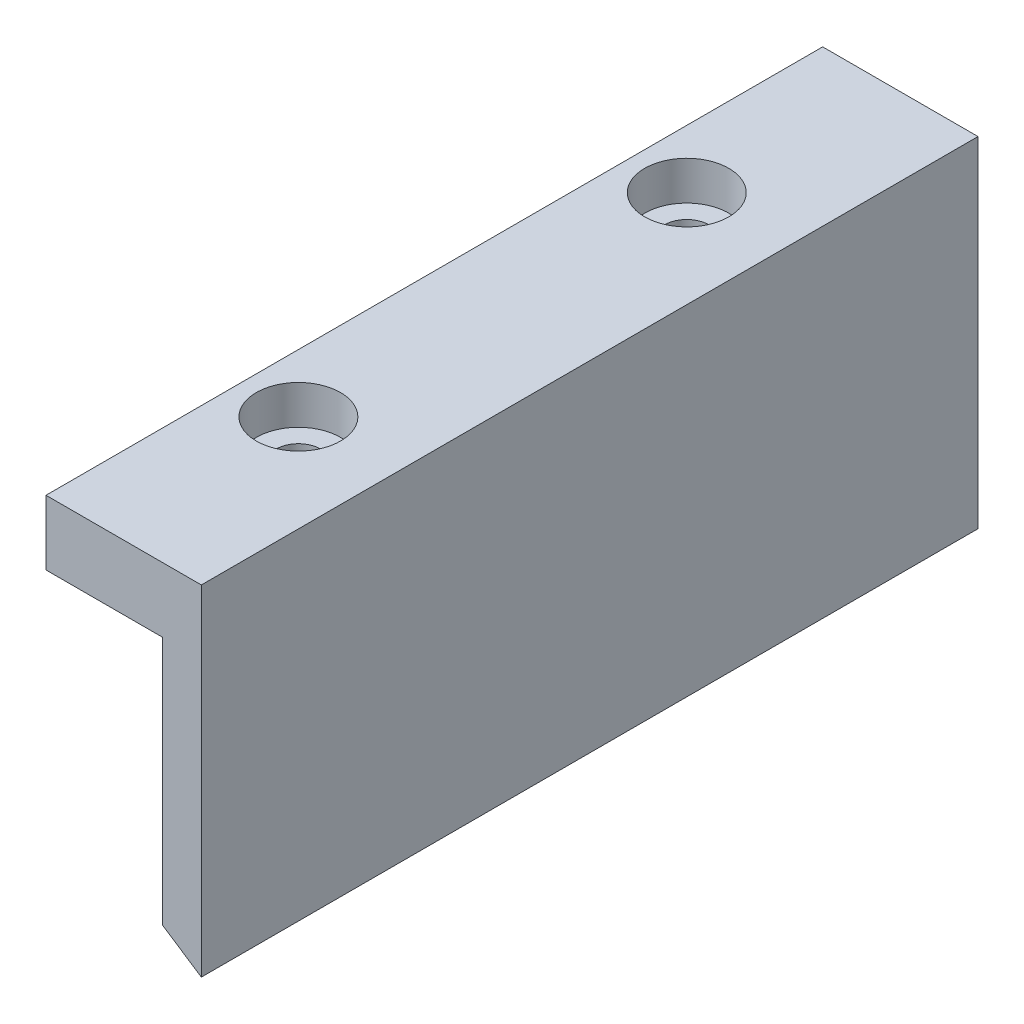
from build123d import *

# Parameters (mm, degrees)
BOSS_EXTRUDE1_DEPTH            = 60
CBORE_FOR_M3_SHCS1_D           = 3.4
CBORE_FOR_M3_SHCS1_DEPTH       = 5
CBORE_FOR_M3_SHCS1_CBORE_D     = 6.5
CBORE_FOR_M3_SHCS1_CBORE_DEPTH = 3
CBORE_FOR_M3_SHCS1_TIP         = 1.021463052


with BuildPart() as part:
    # Sketch3 → Boss-Extrude1 (new body)
    with BuildSketch(Plane.XY):
        Polygon((0, 60.2), (0, 33.96), (-3, 35.94), (-3, 55.2), (-12, 55.2), (-12, 60.2), align=None)
    extrude(amount=BOSS_EXTRUDE1_DEPTH)

    # CBORE for M3 SHCS1
    with Locations(Plane(origin=(0, 60.2, 0), x_dir=(1, 0, 0), z_dir=(0, 1, 0))):
        with Locations((-7.5, -15), (-7.5, -45)):
            CounterBoreHole(CBORE_FOR_M3_SHCS1_D / 2, CBORE_FOR_M3_SHCS1_CBORE_D / 2, CBORE_FOR_M3_SHCS1_CBORE_DEPTH, depth=CBORE_FOR_M3_SHCS1_DEPTH)
            with Locations((0, 0, -(CBORE_FOR_M3_SHCS1_DEPTH + CBORE_FOR_M3_SHCS1_TIP / 2))):  # 118° drill point
                Cone(0, CBORE_FOR_M3_SHCS1_D / 2, CBORE_FOR_M3_SHCS1_TIP, mode=Mode.SUBTRACT)


solid = part.part
